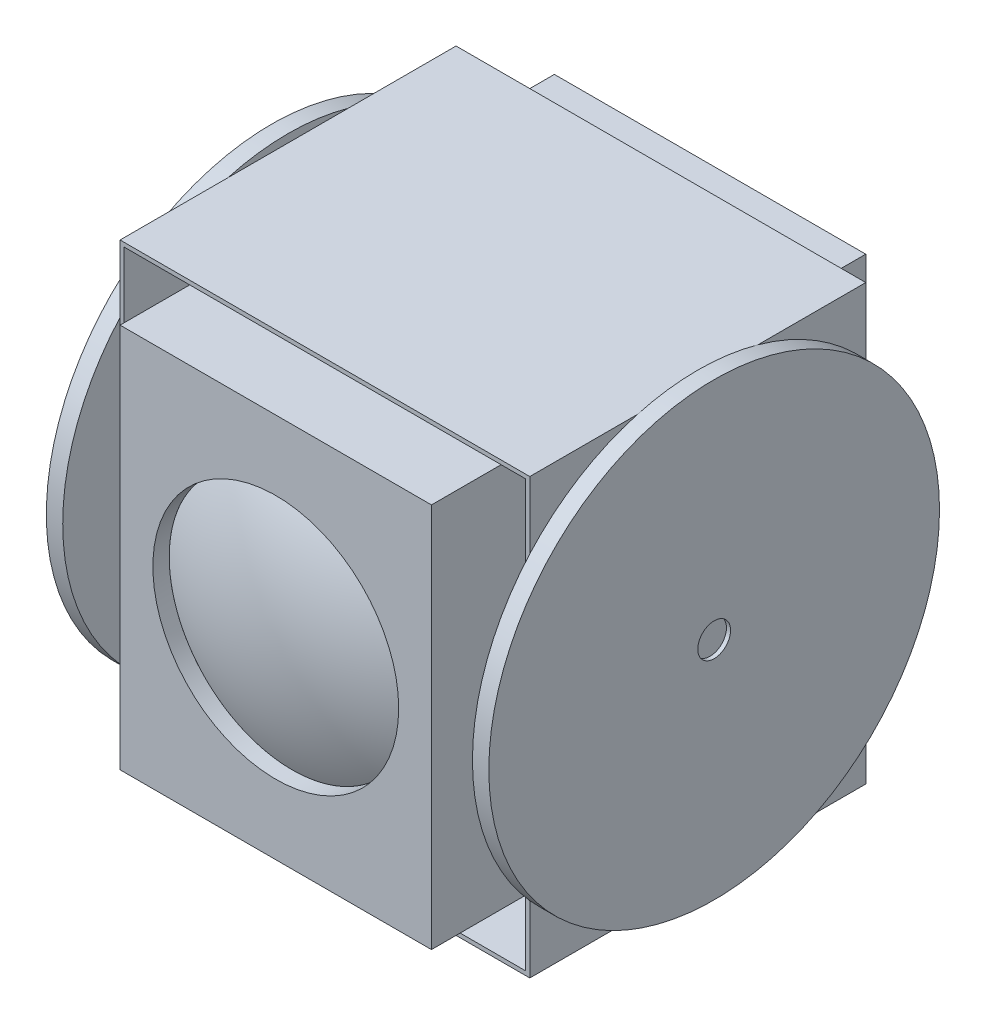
from build123d import *

# Parameters (mm, degrees)
SKETCH1_R                = 34.925
BOSS_EXTRUDE1_DEPTH      = 2.54
SKETCH2_W                = 63.5
SKETCH2_H                = 52.07
BOSS_EXTRUDE2_DEPTH      = 0.635
BOSS_EXTRUDE3_DEPTH      = 7.62
BOSS_EXTRUDE3_DEPTH_BACK = 59.69
SKETCH4_W                = 48.26
SKETCH4_H                = 59.69
SKETCH5_R                = 19.05
CUT_EXTRUDE1_DEPTH       = 2.54
SKETCH7_W                = 52.07
SKETCH7_H                = 66.04
BOSS_EXTRUDE4_DEPTH      = 0.635
SKETCH8_R                = 2.54
CUT_EXTRUDE2_DEPTH       = 0.635


with BuildPart() as part:
    # Sketch1 → Boss-Extrude1 (new body)
    with BuildSketch(Plane(origin=(0, 0, 0), x_dir=(0, 0, -1), z_dir=(1, 0, 0))):
        Circle(SKETCH1_R)
    boss_extrude1 = extrude(amount=BOSS_EXTRUDE1_DEPTH)

    # Sketch2 → Boss-Extrude2 (add)
    with BuildSketch(Plane(origin=(0, 33.02, 0), x_dir=(1, 0, 0), z_dir=(0, 1, 0))):
        with Locations((-31.75, 0)):
            Rectangle(SKETCH2_W, SKETCH2_H)
    boss_extrude2 = extrude(amount=BOSS_EXTRUDE2_DEPTH)

    # Mirror1: Boss-Extrude2 across plane
    add(boss_extrude2.mirror(Plane.ZX))

    # Mirror2: Boss-Extrude1 across plane
    add(boss_extrude1.mirror(Plane.ZY.offset(31.75)))

    # Sketch7 → Boss-Extrude4 (add)
    with BuildSketch(Plane.ZY):
        Rectangle(SKETCH7_W, SKETCH7_H)
    boss_extrude4 = extrude(amount=BOSS_EXTRUDE4_DEPTH)

    # Mirror3: Boss-Extrude4 across plane
    add(boss_extrude4.mirror(Plane.ZY.offset(31.75)))

    # Sketch8 → Cut-Extrude2 (cut)
    with BuildSketch(Plane(origin=(2.54, 0, 0), x_dir=(0, 0, -1), z_dir=(1, 0, 0))):
        Circle(SKETCH8_R)
    extrude(amount=-CUT_EXTRUDE2_DEPTH, mode=Mode.SUBTRACT)


with BuildPart() as body_2:
    # Sketch4 → Boss-Extrude3 (new, two sides: drawn at the far end of the back side and taken through both)
    with BuildSketch(Plane.XY.offset(26.035).offset(-BOSS_EXTRUDE3_DEPTH_BACK)):
        with Locations((-31.75, 0)):
            Rectangle(SKETCH4_W, SKETCH4_H)
    extrude(amount=BOSS_EXTRUDE3_DEPTH + BOSS_EXTRUDE3_DEPTH_BACK)

    # Sketch5 → Cut-Extrude1 (cut)
    with BuildSketch(Plane.XY.offset(33.655)):
        with Locations((-31.75, 0)):
            Circle(SKETCH5_R)
    extrude(amount=-CUT_EXTRUDE1_DEPTH, mode=Mode.SUBTRACT)

    # Sketch6 → Revolve1 (revolve)
    with BuildSketch(Plane(origin=(0, 0, 0), x_dir=(1, 0, 0), z_dir=(0, 1, 0))):
        with BuildLine():
            Line((-31.75, -31.115), (-31.75, -35.542689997))
            ThreePointArc((-31.75, -35.542689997), (-21.972790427, -34.421203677), (-12.703455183, -31.115))
            Line((-12.703455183, -31.115), (-31.75, -31.115))
        make_face()
    revolve(axis=Axis((-31.75, 0, 31.115), (0, 0, 1)))


solid = Compound([part.part, body_2.part])
